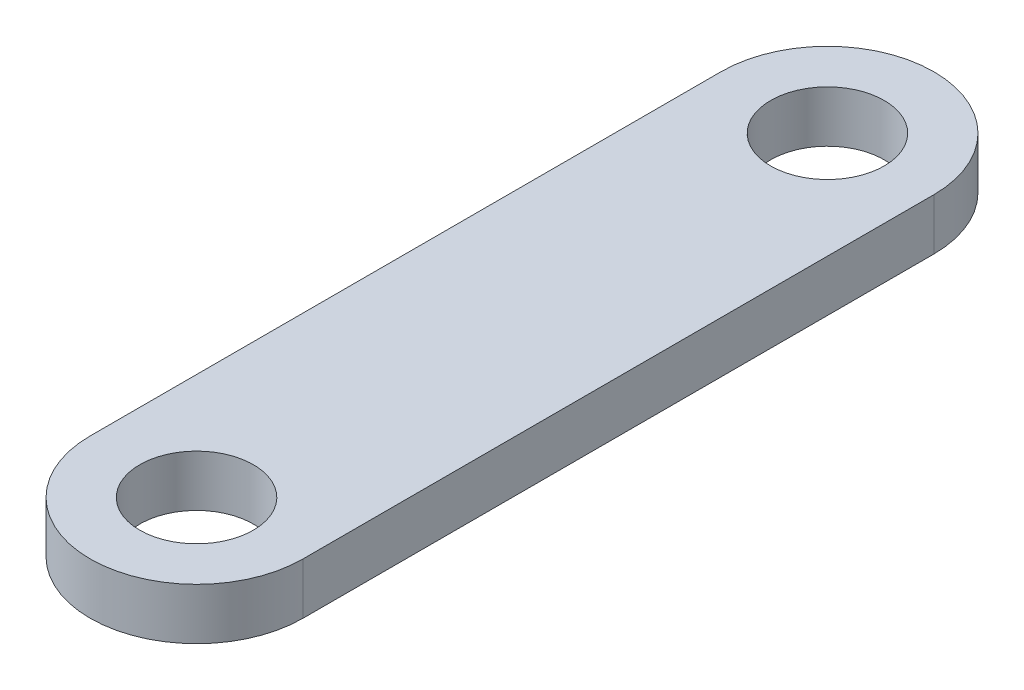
from build123d import *

# Parameters (mm, degrees)
SKETCH1_R           = 2.286
BOSS_EXTRUDE1_DEPTH = 2.07


with BuildPart() as part:
    # Sketch1 → Boss-Extrude1 (new body)
    with BuildSketch(Plane(origin=(0, 0, 0), x_dir=(1, 0, 0), z_dir=(0, 1, 0))):
        with BuildLine():
            Line((-4.286416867, 0), (-4.286416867, 25.4))
            ThreePointArc((-4.286416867, 25.4), (0, 29.686416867), (4.286416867, 25.4))
            Line((4.286416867, 25.4), (4.286416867, 0))
            ThreePointArc((4.286416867, 0), (0, -4.286416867), (-4.286416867, 0))
        make_face()
        with Locations(Location((0, 0, 0), (0, 0, 270))):
            Circle(SKETCH1_R, mode=Mode.SUBTRACT)
        with Locations(Location((0, 25.4, 0), (0, 0, 270))):
            Circle(SKETCH1_R, mode=Mode.SUBTRACT)
    extrude(amount=BOSS_EXTRUDE1_DEPTH)


solid = part.part
